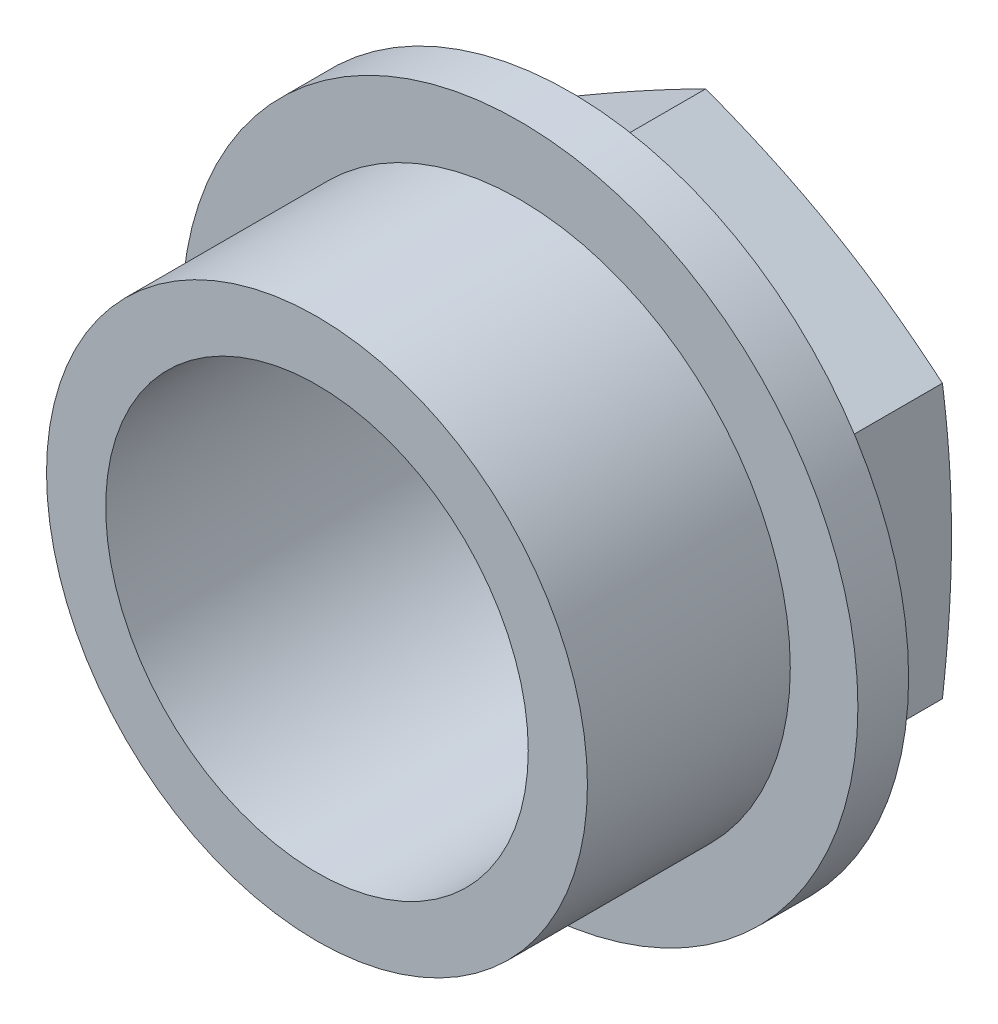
from build123d import *

# Parameters (mm, degrees)
SKETCH_2_R                    = 10
EXTRUDE_1_DEPTH               = 1.5
SKETCH_3_R                    = 8
EXTRUDE_2_DEPTH               = 6
EXTRUDE_3_DEPTH               = 6
HOLE_WIZARD_12_5_12_5_1_D     = 12.5
HOLE_WIZARD_12_5_12_5_1_DEPTH = 9
HOLE_WIZARD_12_5_12_5_1_TIP   = 3.755378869


with BuildPart() as part:
    # Sketch 2 → Extrude 1 (new body)
    with BuildSketch(Plane.XY):
        Circle(SKETCH_2_R)
    extrude(amount=EXTRUDE_1_DEPTH)

    # Sketch 3 → Extrude 2 (add)
    with BuildSketch(Plane.XY.offset(1.5)):
        Circle(SKETCH_3_R)
    extrude(amount=EXTRUDE_2_DEPTH)

    # Sketch 4 → Extrude 3 (add)
    with BuildSketch(Plane(origin=(0, 0, 0), x_dir=(-1, 0, 0), z_dir=(0, 0, -1))):
        Polygon((0, 8.082903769), (-7, 4.041451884), (-7, -4.041451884), (0, -8.082903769), (7, -4.041451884), (7, 4.041451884), align=None)
    extrude(amount=EXTRUDE_3_DEPTH)

    # Sketch 6 → Cut-Revolve 6 (revolve, cut)
    with BuildSketch(Plane(origin=(0, 0, 0), x_dir=(0, 0, -1), z_dir=(1, 0, 0))):
        Polygon((6, 8.082903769), (6, 0.01), (4, 8.082903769), align=None)
    revolve(axis=Axis((0, 0, -6), (0, 0, 1)), mode=Mode.SUBTRACT)

    # Hole Wizard 12.5 _12.5_ _1
    with Locations(Plane.XY.offset(7.5)):
        with Locations((0, 0)):
            Hole(HOLE_WIZARD_12_5_12_5_1_D / 2, depth=HOLE_WIZARD_12_5_12_5_1_DEPTH)
            with Locations((0, 0, -(HOLE_WIZARD_12_5_12_5_1_DEPTH + HOLE_WIZARD_12_5_12_5_1_TIP / 2))):  # 118° drill point
                Cone(0, HOLE_WIZARD_12_5_12_5_1_D / 2, HOLE_WIZARD_12_5_12_5_1_TIP, mode=Mode.SUBTRACT)


solid = part.part
